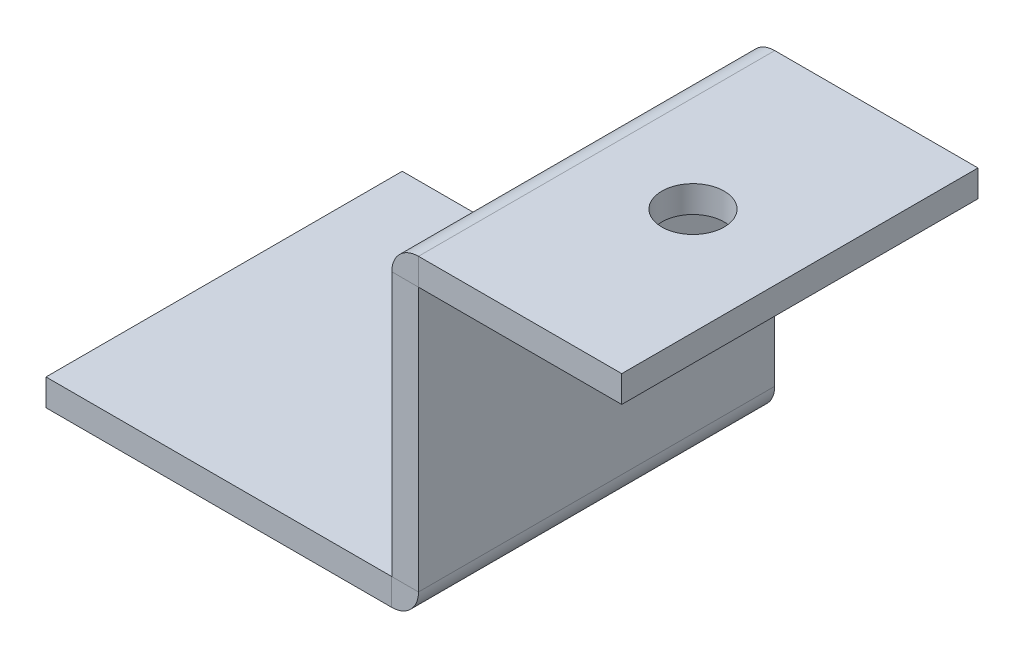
ISO-10303-21;
HEADER;
FILE_DESCRIPTION(('STEP AP214'),'2;1');
FILE_NAME('part.step','',(''),(''),'','','');
FILE_SCHEMA(('AUTOMOTIVE_DESIGN { 1 0 10303 214 1 1 1 1 }'));
ENDSEC;
DATA;
#1=APPLICATION_CONTEXT('core data for automotive mechanical design processes');
#2=APPLICATION_PROTOCOL_DEFINITION('international standard','automotive_design',2000,#1);
#3=PRODUCT_CONTEXT('',#1,'mechanical');
#4=PRODUCT('Part','Part','',(#3));
#5=PRODUCT_RELATED_PRODUCT_CATEGORY('part','',(#4));
#6=PRODUCT_DEFINITION_FORMATION('','',#4);
#7=PRODUCT_DEFINITION_CONTEXT('part definition',#1,'design');
#8=PRODUCT_DEFINITION('design','',#6,#7);
#9=PRODUCT_DEFINITION_SHAPE('','',#8);
#10=(LENGTH_UNIT() NAMED_UNIT(*) SI_UNIT(.MILLI.,.METRE.));
#11=(NAMED_UNIT(*) PLANE_ANGLE_UNIT() SI_UNIT($,.RADIAN.));
#12=(NAMED_UNIT(*) SI_UNIT($,.STERADIAN.) SOLID_ANGLE_UNIT());
#13=UNCERTAINTY_MEASURE_WITH_UNIT(LENGTH_MEASURE(1.E-05),#10,'distance_accuracy_value','');
#14=(GEOMETRIC_REPRESENTATION_CONTEXT(3) GLOBAL_UNCERTAINTY_ASSIGNED_CONTEXT((#13)) GLOBAL_UNIT_ASSIGNED_CONTEXT((#10,
#11,#12)) REPRESENTATION_CONTEXT('',''));
#15=CARTESIAN_POINT('',(0.,0.,0.));
#16=DIRECTION('',(0.,0.,1.));
#17=DIRECTION('',(1.,0.,0.));
#18=AXIS2_PLACEMENT_3D('',#15,#16,#17);
#19=CARTESIAN_POINT('',(-11.4111659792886,11.0888340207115,0.));
#20=DIRECTION('',(-1.,0.,0.));
#21=DIRECTION('',(0.,0.,1.));
#22=AXIS2_PLACEMENT_3D('',#19,#20,#21);
#23=PLANE('',#22);
#24=DIRECTION('',(0.,1.,0.));
#25=VECTOR('',#24,1.);
#26=CARTESIAN_POINT('',(-11.4111659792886,11.0888340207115,0.));
#27=LINE('',#26,#25);
#28=CARTESIAN_POINT('',(-11.4111659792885,-16.321331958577,0.));
#29=VERTEX_POINT('',#28);
#30=CARTESIAN_POINT('',(-11.4111659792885,-1.501,0.));
#31=VERTEX_POINT('',#30);
#32=EDGE_CURVE('E48',#29,#31,#27,.T.);
#33=ORIENTED_EDGE('',*,*,#32,.F.);
#34=DIRECTION('',(0.,0.,-1.));
#35=VECTOR('',#34,1.);
#36=CARTESIAN_POINT('',(-11.4111659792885,-16.321331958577,0.));
#37=LINE('',#36,#35);
#38=CARTESIAN_POINT('',(-11.4111659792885,-16.321331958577,-20.));
#39=VERTEX_POINT('',#38);
#40=EDGE_CURVE('E235',#29,#39,#37,.T.);
#41=ORIENTED_EDGE('',*,*,#40,.T.);
#42=DIRECTION('',(0.,-1.,0.));
#43=VECTOR('',#42,1.);
#44=CARTESIAN_POINT('',(-11.4111659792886,11.0888340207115,-20.));
#45=LINE('',#44,#43);
#46=CARTESIAN_POINT('',(-11.4111659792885,-1.501,-20.));
#47=VERTEX_POINT('',#46);
#48=EDGE_CURVE('E243',#47,#39,#45,.T.);
#49=ORIENTED_EDGE('',*,*,#48,.F.);
#50=DIRECTION('',(0.,0.,-1.));
#51=VECTOR('',#50,1.);
#52=CARTESIAN_POINT('',(-11.4111659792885,-1.501,0.));
#53=LINE('',#52,#51);
#54=EDGE_CURVE('E226',#31,#47,#53,.T.);
#55=ORIENTED_EDGE('',*,*,#54,.F.);
#56=EDGE_LOOP('',(#33,#41,#49,#55));
#57=FACE_BOUND('',#56,.T.);
#58=ADVANCED_FACE('F44',(#57),#23,.F.);
#59=CARTESIAN_POINT('',(-11.4111659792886,11.0888340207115,0.));
#60=DIRECTION('',(0.,0.,1.));
#61=DIRECTION('',(0.,1.,0.));
#62=AXIS2_PLACEMENT_3D('',#59,#60,#61);
#63=PLANE('',#62);
#64=DIRECTION('',(-1.,0.,0.));
#65=VECTOR('',#64,1.);
#66=CARTESIAN_POINT('',(-11.4111659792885,-16.321331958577,0.));
#67=LINE('',#66,#65);
#68=CARTESIAN_POINT('',(-12.9111659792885,-16.321331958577,0.));
#69=VERTEX_POINT('',#68);
#70=EDGE_CURVE('E238',#29,#69,#67,.T.);
#71=ORIENTED_EDGE('',*,*,#70,.F.);
#72=ORIENTED_EDGE('',*,*,#32,.T.);
#73=DIRECTION('',(-1.,0.,0.));
#74=VECTOR('',#73,1.);
#75=CARTESIAN_POINT('',(-11.4111659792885,-1.501,0.));
#76=LINE('',#75,#74);
#77=CARTESIAN_POINT('',(-12.9111659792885,-1.50100000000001,0.));
#78=VERTEX_POINT('',#77);
#79=EDGE_CURVE('E233',#31,#78,#76,.T.);
#80=ORIENTED_EDGE('',*,*,#79,.T.);
#81=DIRECTION('',(0.,1.,0.));
#82=VECTOR('',#81,1.);
#83=CARTESIAN_POINT('',(-12.9111659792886,11.0888340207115,0.));
#84=LINE('',#83,#82);
#85=EDGE_CURVE('E69',#69,#78,#84,.T.);
#86=ORIENTED_EDGE('',*,*,#85,.F.);
#87=EDGE_LOOP('',(#71,#72,#80,#86));
#88=FACE_BOUND('',#87,.T.);
#89=ADVANCED_FACE('F249',(#88),#63,.T.);
#90=CARTESIAN_POINT('',(-11.4111659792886,11.0888340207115,-20.));
#91=DIRECTION('',(0.,0.,-1.));
#92=DIRECTION('',(0.,-1.,0.));
#93=AXIS2_PLACEMENT_3D('',#90,#91,#92);
#94=PLANE('',#93);
#95=DIRECTION('',(1.,0.,0.));
#96=VECTOR('',#95,1.);
#97=CARTESIAN_POINT('',(-11.4111659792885,-16.321331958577,-20.));
#98=LINE('',#97,#96);
#99=CARTESIAN_POINT('',(-12.9111659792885,-16.321331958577,-20.));
#100=VERTEX_POINT('',#99);
#101=EDGE_CURVE('E12',#100,#39,#98,.T.);
#102=ORIENTED_EDGE('',*,*,#101,.F.);
#103=DIRECTION('',(0.,-1.,0.));
#104=VECTOR('',#103,1.);
#105=CARTESIAN_POINT('',(-12.9111659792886,11.0888340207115,-20.));
#106=LINE('',#105,#104);
#107=CARTESIAN_POINT('',(-12.9111659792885,-1.50100000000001,-20.));
#108=VERTEX_POINT('',#107);
#109=EDGE_CURVE('E61',#108,#100,#106,.T.);
#110=ORIENTED_EDGE('',*,*,#109,.F.);
#111=DIRECTION('',(1.,0.,0.));
#112=VECTOR('',#111,1.);
#113=CARTESIAN_POINT('',(-11.4111659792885,-1.501,-20.));
#114=LINE('',#113,#112);
#115=EDGE_CURVE('E229',#108,#47,#114,.T.);
#116=ORIENTED_EDGE('',*,*,#115,.T.);
#117=ORIENTED_EDGE('',*,*,#48,.T.);
#118=EDGE_LOOP('',(#102,#110,#116,#117));
#119=FACE_BOUND('',#118,.T.);
#120=ADVANCED_FACE('F46',(#119),#94,.T.);
#121=CARTESIAN_POINT('',(-12.9111659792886,11.0888340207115,0.));
#122=DIRECTION('',(-1.,0.,0.));
#123=DIRECTION('',(0.,0.,1.));
#124=AXIS2_PLACEMENT_3D('',#121,#122,#123);
#125=PLANE('',#124);
#126=DIRECTION('',(0.,0.,-1.));
#127=VECTOR('',#126,1.);
#128=CARTESIAN_POINT('',(-12.9111659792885,-16.321331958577,0.));
#129=LINE('',#128,#127);
#130=EDGE_CURVE('E53',#69,#100,#129,.T.);
#131=ORIENTED_EDGE('',*,*,#130,.F.);
#132=ORIENTED_EDGE('',*,*,#85,.T.);
#133=DIRECTION('',(0.,0.,-1.));
#134=VECTOR('',#133,1.);
#135=CARTESIAN_POINT('',(-12.9111659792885,-1.50100000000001,0.));
#136=LINE('',#135,#134);
#137=EDGE_CURVE('E231',#78,#108,#136,.T.);
#138=ORIENTED_EDGE('',*,*,#137,.T.);
#139=ORIENTED_EDGE('',*,*,#109,.T.);
#140=EDGE_LOOP('',(#131,#132,#138,#139));
#141=FACE_BOUND('',#140,.T.);
#142=ADVANCED_FACE('F245',(#141),#125,.T.);
#143=CARTESIAN_POINT('',(0.,-1.5,0.));
#144=DIRECTION('',(1.,0.,0.));
#145=DIRECTION('',(0.,0.,-1.));
#146=AXIS2_PLACEMENT_3D('',#143,#144,#145);
#147=PLANE('',#146);
#148=DIRECTION('',(0.,0.,-1.));
#149=VECTOR('',#148,1.);
#150=CARTESIAN_POINT('',(0.,0.,0.));
#151=LINE('',#150,#149);
#152=CARTESIAN_POINT('',(0.,0.,0.));
#153=VERTEX_POINT('',#152);
#154=CARTESIAN_POINT('',(0.,0.,-20.));
#155=VERTEX_POINT('',#154);
#156=EDGE_CURVE('E197',#153,#155,#151,.T.);
#157=ORIENTED_EDGE('',*,*,#156,.F.);
#158=DIRECTION('',(0.,1.,0.));
#159=VECTOR('',#158,1.);
#160=CARTESIAN_POINT('',(0.,-1.5,0.));
#161=LINE('',#160,#159);
#162=CARTESIAN_POINT('',(0.,-1.5,0.));
#163=VERTEX_POINT('',#162);
#164=EDGE_CURVE('E190',#163,#153,#161,.T.);
#165=ORIENTED_EDGE('',*,*,#164,.F.);
#166=DIRECTION('',(0.,0.,-1.));
#167=VECTOR('',#166,1.);
#168=CARTESIAN_POINT('',(0.,-1.5,0.));
#169=LINE('',#168,#167);
#170=CARTESIAN_POINT('',(0.,-1.5,-20.));
#171=VERTEX_POINT('',#170);
#172=EDGE_CURVE('E215',#163,#171,#169,.T.);
#173=ORIENTED_EDGE('',*,*,#172,.T.);
#174=DIRECTION('',(0.,1.,0.));
#175=VECTOR('',#174,1.);
#176=CARTESIAN_POINT('',(0.,-1.5,-20.));
#177=LINE('',#176,#175);
#178=EDGE_CURVE('E213',#171,#155,#177,.T.);
#179=ORIENTED_EDGE('',*,*,#178,.T.);
#180=EDGE_LOOP('',(#157,#165,#173,#179));
#181=FACE_BOUND('',#180,.T.);
#182=ADVANCED_FACE('F286',(#181),#147,.T.);
#183=CARTESIAN_POINT('',(-6.,-1.5,-10.));
#184=DIRECTION('',(0.,1.,0.));
#185=DIRECTION('',(0.,0.,1.));
#186=AXIS2_PLACEMENT_3D('',#183,#184,#185);
#187=CYLINDRICAL_SURFACE('',#186,1.75);
#188=CARTESIAN_POINT('',(-6.,-1.5,-10.));
#189=DIRECTION('',(0.,1.,0.));
#190=DIRECTION('',(0.,0.,1.));
#191=AXIS2_PLACEMENT_3D('',#188,#189,#190);
#192=CIRCLE('',#191,1.75);
#193=CARTESIAN_POINT('',(-6.,-1.5,-8.25));
#194=VERTEX_POINT('',#193);
#195=EDGE_CURVE('E207',#194,#194,#192,.T.);
#196=ORIENTED_EDGE('',*,*,#195,.F.);
#197=EDGE_LOOP('',(#196));
#198=FACE_BOUND('',#197,.T.);
#199=CARTESIAN_POINT('',(-6.,0.,-10.));
#200=DIRECTION('',(0.,1.,0.));
#201=DIRECTION('',(0.,0.,1.));
#202=AXIS2_PLACEMENT_3D('',#199,#200,#201);
#203=CIRCLE('',#202,1.75);
#204=CARTESIAN_POINT('',(-6.,0.,-8.25));
#205=VERTEX_POINT('',#204);
#206=EDGE_CURVE('E210',#205,#205,#203,.T.);
#207=ORIENTED_EDGE('',*,*,#206,.T.);
#208=EDGE_LOOP('',(#207));
#209=FACE_BOUND('',#208,.T.);
#210=ADVANCED_FACE('F288',(#198,#209),#187,.F.);
#211=CARTESIAN_POINT('',(0.,-1.5,0.));
#212=DIRECTION('',(0.,1.,0.));
#213=DIRECTION('',(0.,0.,1.));
#214=AXIS2_PLACEMENT_3D('',#211,#212,#213);
#215=PLANE('',#214);
#216=ORIENTED_EDGE('',*,*,#195,.T.);
#217=EDGE_LOOP('',(#216));
#218=FACE_BOUND('',#217,.T.);
#219=DIRECTION('',(1.,0.,0.));
#220=VECTOR('',#219,1.);
#221=CARTESIAN_POINT('',(0.,-1.5,0.));
#222=LINE('',#221,#220);
#223=CARTESIAN_POINT('',(-11.4101659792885,-1.5,0.));
#224=VERTEX_POINT('',#223);
#225=EDGE_CURVE('E193',#224,#163,#222,.T.);
#226=ORIENTED_EDGE('',*,*,#225,.F.);
#227=DIRECTION('',(0.,0.,-1.));
#228=VECTOR('',#227,1.);
#229=CARTESIAN_POINT('',(-11.4101659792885,-1.5,0.));
#230=LINE('',#229,#228);
#231=CARTESIAN_POINT('',(-11.4101659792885,-1.5,-20.));
#232=VERTEX_POINT('',#231);
#233=EDGE_CURVE('E204',#224,#232,#230,.T.);
#234=ORIENTED_EDGE('',*,*,#233,.T.);
#235=DIRECTION('',(-1.,0.,0.));
#236=VECTOR('',#235,1.);
#237=CARTESIAN_POINT('',(0.,-1.5,-20.));
#238=LINE('',#237,#236);
#239=EDGE_CURVE('E202',#171,#232,#238,.T.);
#240=ORIENTED_EDGE('',*,*,#239,.F.);
#241=ORIENTED_EDGE('',*,*,#172,.F.);
#242=EDGE_LOOP('',(#226,#234,#240,#241));
#243=FACE_BOUND('',#242,.T.);
#244=ADVANCED_FACE('F283',(#218,#243),#215,.F.);
#245=CARTESIAN_POINT('',(0.,-1.5,-20.));
#246=DIRECTION('',(0.,0.,-1.));
#247=DIRECTION('',(-1.,0.,0.));
#248=AXIS2_PLACEMENT_3D('',#245,#246,#247);
#249=PLANE('',#248);
#250=DIRECTION('',(0.,-1.,0.));
#251=VECTOR('',#250,1.);
#252=CARTESIAN_POINT('',(-11.4101659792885,-1.5,-20.));
#253=LINE('',#252,#251);
#254=CARTESIAN_POINT('',(-11.4101659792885,0.,-20.));
#255=VERTEX_POINT('',#254);
#256=EDGE_CURVE('E218',#255,#232,#253,.T.);
#257=ORIENTED_EDGE('',*,*,#256,.F.);
#258=DIRECTION('',(-1.,0.,0.));
#259=VECTOR('',#258,1.);
#260=CARTESIAN_POINT('',(0.,0.,-20.));
#261=LINE('',#260,#259);
#262=EDGE_CURVE('E195',#155,#255,#261,.T.);
#263=ORIENTED_EDGE('',*,*,#262,.F.);
#264=ORIENTED_EDGE('',*,*,#178,.F.);
#265=ORIENTED_EDGE('',*,*,#239,.T.);
#266=EDGE_LOOP('',(#257,#263,#264,#265));
#267=FACE_BOUND('',#266,.T.);
#268=ADVANCED_FACE('F271',(#267),#249,.T.);
#269=CARTESIAN_POINT('',(0.,0.,0.));
#270=DIRECTION('',(0.,1.,0.));
#271=DIRECTION('',(0.,0.,1.));
#272=AXIS2_PLACEMENT_3D('',#269,#270,#271);
#273=PLANE('',#272);
#274=DIRECTION('',(0.,0.,-1.));
#275=VECTOR('',#274,1.);
#276=CARTESIAN_POINT('',(-11.4101659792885,0.,0.));
#277=LINE('',#276,#275);
#278=CARTESIAN_POINT('',(-11.4101659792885,0.,0.));
#279=VERTEX_POINT('',#278);
#280=EDGE_CURVE('E221',#279,#255,#277,.T.);
#281=ORIENTED_EDGE('',*,*,#280,.F.);
#282=DIRECTION('',(1.,0.,0.));
#283=VECTOR('',#282,1.);
#284=CARTESIAN_POINT('',(0.,0.,0.));
#285=LINE('',#284,#283);
#286=EDGE_CURVE('E200',#279,#153,#285,.T.);
#287=ORIENTED_EDGE('',*,*,#286,.T.);
#288=ORIENTED_EDGE('',*,*,#156,.T.);
#289=ORIENTED_EDGE('',*,*,#262,.T.);
#290=EDGE_LOOP('',(#281,#287,#288,#289));
#291=FACE_BOUND('',#290,.T.);
#292=ORIENTED_EDGE('',*,*,#206,.F.);
#293=EDGE_LOOP('',(#292));
#294=FACE_BOUND('',#293,.T.);
#295=ADVANCED_FACE('F266',(#291,#294),#273,.T.);
#296=CARTESIAN_POINT('',(0.,-1.5,0.));
#297=DIRECTION('',(0.,0.,1.));
#298=DIRECTION('',(1.,0.,0.));
#299=AXIS2_PLACEMENT_3D('',#296,#297,#298);
#300=PLANE('',#299);
#301=DIRECTION('',(0.,1.,0.));
#302=VECTOR('',#301,1.);
#303=CARTESIAN_POINT('',(-11.4101659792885,-1.5,0.));
#304=LINE('',#303,#302);
#305=EDGE_CURVE('E185',#224,#279,#304,.T.);
#306=ORIENTED_EDGE('',*,*,#305,.F.);
#307=ORIENTED_EDGE('',*,*,#225,.T.);
#308=ORIENTED_EDGE('',*,*,#164,.T.);
#309=ORIENTED_EDGE('',*,*,#286,.F.);
#310=EDGE_LOOP('',(#306,#307,#308,#309));
#311=FACE_BOUND('',#310,.T.);
#312=ADVANCED_FACE('F261',(#311),#300,.T.);
#313=CARTESIAN_POINT('',(-11.4101659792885,-1.501,0.));
#314=DIRECTION('',(0.,0.,-1.));
#315=DIRECTION('',(-1.,0.,0.));
#316=AXIS2_PLACEMENT_3D('',#313,#314,#315);
#317=PLANE('',#316);
#318=ORIENTED_EDGE('',*,*,#305,.T.);
#319=CARTESIAN_POINT('',(-11.4101659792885,-1.501,0.));
#320=DIRECTION('',(0.,0.,-1.));
#321=DIRECTION('',(-1.,0.,0.));
#322=AXIS2_PLACEMENT_3D('',#319,#320,#321);
#323=CIRCLE('',#322,1.501);
#324=EDGE_CURVE('E173',#279,#78,#323,.F.);
#325=ORIENTED_EDGE('',*,*,#324,.T.);
#326=ORIENTED_EDGE('',*,*,#79,.F.);
#327=CARTESIAN_POINT('',(-11.4101659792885,-1.501,0.));
#328=DIRECTION('',(0.,0.,1.));
#329=DIRECTION('',(-1.,0.,0.));
#330=AXIS2_PLACEMENT_3D('',#327,#328,#329);
#331=CIRCLE('',#330,0.000999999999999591);
#332=EDGE_CURVE('E178',#224,#31,#331,.T.);
#333=ORIENTED_EDGE('',*,*,#332,.F.);
#334=EDGE_LOOP('',(#318,#325,#326,#333));
#335=FACE_BOUND('',#334,.T.);
#336=ADVANCED_FACE('F257',(#335),#317,.F.);
#337=CARTESIAN_POINT('',(-11.4101659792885,-1.501,-20.));
#338=DIRECTION('',(0.,0.,1.));
#339=DIRECTION('',(1.,0.,0.));
#340=AXIS2_PLACEMENT_3D('',#337,#338,#339);
#341=PLANE('',#340);
#342=ORIENTED_EDGE('',*,*,#115,.F.);
#343=CARTESIAN_POINT('',(-11.4101659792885,-1.501,-20.));
#344=DIRECTION('',(0.,0.,-1.));
#345=DIRECTION('',(-1.,0.,0.));
#346=AXIS2_PLACEMENT_3D('',#343,#344,#345);
#347=CIRCLE('',#346,1.501);
#348=EDGE_CURVE('E182',#108,#255,#347,.T.);
#349=ORIENTED_EDGE('',*,*,#348,.T.);
#350=ORIENTED_EDGE('',*,*,#256,.T.);
#351=CARTESIAN_POINT('',(-11.4101659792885,-1.501,-20.));
#352=DIRECTION('',(0.,0.,-1.));
#353=DIRECTION('',(1.,0.,0.));
#354=AXIS2_PLACEMENT_3D('',#351,#352,#353);
#355=CIRCLE('',#354,0.000999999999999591);
#356=EDGE_CURVE('E181',#47,#232,#355,.T.);
#357=ORIENTED_EDGE('',*,*,#356,.F.);
#358=EDGE_LOOP('',(#342,#349,#350,#357));
#359=FACE_BOUND('',#358,.T.);
#360=ADVANCED_FACE('F275',(#359),#341,.F.);
#361=CARTESIAN_POINT('',(-11.4101659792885,-1.501,10.0908341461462));
#362=DIRECTION('',(0.,0.,-1.));
#363=DIRECTION('',(-1.,0.,0.));
#364=AXIS2_PLACEMENT_3D('',#361,#362,#363);
#365=CYLINDRICAL_SURFACE('',#364,0.001);
#366=ORIENTED_EDGE('',*,*,#356,.T.);
#367=ORIENTED_EDGE('',*,*,#233,.F.);
#368=ORIENTED_EDGE('',*,*,#332,.T.);
#369=ORIENTED_EDGE('',*,*,#54,.T.);
#370=EDGE_LOOP('',(#366,#367,#368,#369));
#371=FACE_BOUND('',#370,.T.);
#372=ADVANCED_FACE('F281',(#371),#365,.F.);
#373=CARTESIAN_POINT('',(-11.4101659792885,-1.501,10.0908341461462));
#374=DIRECTION('',(0.,0.,-1.));
#375=DIRECTION('',(-1.,0.,0.));
#376=AXIS2_PLACEMENT_3D('',#373,#374,#375);
#377=CYLINDRICAL_SURFACE('',#376,1.501);
#378=ORIENTED_EDGE('',*,*,#348,.F.);
#379=ORIENTED_EDGE('',*,*,#137,.F.);
#380=ORIENTED_EDGE('',*,*,#324,.F.);
#381=ORIENTED_EDGE('',*,*,#280,.T.);
#382=EDGE_LOOP('',(#378,#379,#380,#381));
#383=FACE_BOUND('',#382,.T.);
#384=ADVANCED_FACE('F256',(#383),#377,.T.);
#385=CARTESIAN_POINT('',(-12.9121659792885,-16.321331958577,0.));
#386=DIRECTION('',(0.,0.,1.));
#387=DIRECTION('',(1.,0.,0.));
#388=AXIS2_PLACEMENT_3D('',#385,#386,#387);
#389=PLANE('',#388);
#390=ORIENTED_EDGE('',*,*,#70,.T.);
#391=CARTESIAN_POINT('',(-12.9121659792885,-16.321331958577,0.));
#392=DIRECTION('',(0.,0.,-1.));
#393=DIRECTION('',(-1.,0.,0.));
#394=AXIS2_PLACEMENT_3D('',#391,#392,#393);
#395=CIRCLE('',#394,0.000999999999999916);
#396=CARTESIAN_POINT('',(-12.9121659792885,-16.322331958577,0.));
#397=VERTEX_POINT('',#396);
#398=EDGE_CURVE('E154',#69,#397,#395,.T.);
#399=ORIENTED_EDGE('',*,*,#398,.T.);
#400=DIRECTION('',(0.,1.,0.));
#401=VECTOR('',#400,1.);
#402=CARTESIAN_POINT('',(-12.9121659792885,-17.822331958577,0.));
#403=LINE('',#402,#401);
#404=CARTESIAN_POINT('',(-12.9121659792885,-17.822331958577,0.));
#405=VERTEX_POINT('',#404);
#406=EDGE_CURVE('E539',#405,#397,#403,.T.);
#407=ORIENTED_EDGE('',*,*,#406,.F.);
#408=CARTESIAN_POINT('',(-12.9121659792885,-16.321331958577,0.));
#409=DIRECTION('',(0.,0.,-1.));
#410=DIRECTION('',(1.,0.,0.));
#411=AXIS2_PLACEMENT_3D('',#408,#409,#410);
#412=CIRCLE('',#411,1.501);
#413=EDGE_CURVE('E166',#29,#405,#412,.T.);
#414=ORIENTED_EDGE('',*,*,#413,.F.);
#415=EDGE_LOOP('',(#390,#399,#407,#414));
#416=FACE_BOUND('',#415,.T.);
#417=ADVANCED_FACE('F354',(#416),#389,.T.);
#418=CARTESIAN_POINT('',(-12.9121659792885,-16.321331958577,-20.));
#419=DIRECTION('',(0.,0.,-1.));
#420=DIRECTION('',(-1.,0.,0.));
#421=AXIS2_PLACEMENT_3D('',#418,#419,#420);
#422=PLANE('',#421);
#423=DIRECTION('',(0.,-1.,0.));
#424=VECTOR('',#423,1.);
#425=CARTESIAN_POINT('',(-12.9121659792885,-17.822331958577,-20.));
#426=LINE('',#425,#424);
#427=CARTESIAN_POINT('',(-12.9121659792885,-16.322331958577,-20.));
#428=VERTEX_POINT('',#427);
#429=CARTESIAN_POINT('',(-12.9121659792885,-17.822331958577,-20.));
#430=VERTEX_POINT('',#429);
#431=EDGE_CURVE('E142',#428,#430,#426,.T.);
#432=ORIENTED_EDGE('',*,*,#431,.F.);
#433=CARTESIAN_POINT('',(-12.9121659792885,-16.321331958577,-20.));
#434=DIRECTION('',(0.,0.,-1.));
#435=DIRECTION('',(-1.,0.,0.));
#436=AXIS2_PLACEMENT_3D('',#433,#434,#435);
#437=CIRCLE('',#436,0.000999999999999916);
#438=EDGE_CURVE('E170',#428,#100,#437,.F.);
#439=ORIENTED_EDGE('',*,*,#438,.T.);
#440=ORIENTED_EDGE('',*,*,#101,.T.);
#441=CARTESIAN_POINT('',(-12.9121659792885,-16.321331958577,-20.));
#442=DIRECTION('',(0.,0.,1.));
#443=DIRECTION('',(-1.,0.,0.));
#444=AXIS2_PLACEMENT_3D('',#441,#442,#443);
#445=CIRCLE('',#444,1.501);
#446=EDGE_CURVE('E169',#430,#39,#445,.T.);
#447=ORIENTED_EDGE('',*,*,#446,.F.);
#448=EDGE_LOOP('',(#432,#439,#440,#447));
#449=FACE_BOUND('',#448,.T.);
#450=ADVANCED_FACE('F361',(#449),#422,.T.);
#451=CARTESIAN_POINT('',(-12.9121659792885,-16.321331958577,10.0908341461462));
#452=DIRECTION('',(0.,0.,-1.));
#453=DIRECTION('',(-1.,0.,0.));
#454=AXIS2_PLACEMENT_3D('',#451,#452,#453);
#455=CYLINDRICAL_SURFACE('',#454,1.501);
#456=ORIENTED_EDGE('',*,*,#446,.T.);
#457=ORIENTED_EDGE('',*,*,#40,.F.);
#458=ORIENTED_EDGE('',*,*,#413,.T.);
#459=DIRECTION('',(0.,0.,-1.));
#460=VECTOR('',#459,1.);
#461=CARTESIAN_POINT('',(-12.9121659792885,-17.822331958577,0.));
#462=LINE('',#461,#460);
#463=EDGE_CURVE('E160',#405,#430,#462,.T.);
#464=ORIENTED_EDGE('',*,*,#463,.T.);
#465=EDGE_LOOP('',(#456,#457,#458,#464));
#466=FACE_BOUND('',#465,.T.);
#467=ADVANCED_FACE('F370',(#466),#455,.T.);
#468=CARTESIAN_POINT('',(-12.9121659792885,-16.321331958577,10.0908341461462));
#469=DIRECTION('',(0.,0.,-1.));
#470=DIRECTION('',(-1.,0.,0.));
#471=AXIS2_PLACEMENT_3D('',#468,#469,#470);
#472=CYLINDRICAL_SURFACE('',#471,0.000999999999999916);
#473=ORIENTED_EDGE('',*,*,#438,.F.);
#474=DIRECTION('',(0.,0.,-1.));
#475=VECTOR('',#474,1.);
#476=CARTESIAN_POINT('',(-12.9121659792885,-16.322331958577,0.));
#477=LINE('',#476,#475);
#478=EDGE_CURVE('E538',#397,#428,#477,.T.);
#479=ORIENTED_EDGE('',*,*,#478,.F.);
#480=ORIENTED_EDGE('',*,*,#398,.F.);
#481=ORIENTED_EDGE('',*,*,#130,.T.);
#482=EDGE_LOOP('',(#473,#479,#480,#481));
#483=FACE_BOUND('',#482,.T.);
#484=ADVANCED_FACE('F378',(#483),#472,.F.);
#485=CARTESIAN_POINT('',(-32.322331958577,-17.822331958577,0.));
#486=DIRECTION('',(-1.,0.,0.));
#487=DIRECTION('',(0.,0.,1.));
#488=AXIS2_PLACEMENT_3D('',#485,#486,#487);
#489=PLANE('',#488);
#490=DIRECTION('',(0.,0.,1.));
#491=VECTOR('',#490,1.);
#492=CARTESIAN_POINT('',(-32.322331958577,-16.322331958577,0.));
#493=LINE('',#492,#491);
#494=CARTESIAN_POINT('',(-32.322331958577,-16.322331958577,-20.));
#495=VERTEX_POINT('',#494);
#496=CARTESIAN_POINT('',(-32.322331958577,-16.322331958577,0.));
#497=VERTEX_POINT('',#496);
#498=EDGE_CURVE('E153',#495,#497,#493,.T.);
#499=ORIENTED_EDGE('',*,*,#498,.F.);
#500=DIRECTION('',(0.,1.,0.));
#501=VECTOR('',#500,1.);
#502=CARTESIAN_POINT('',(-32.322331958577,-17.822331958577,-20.));
#503=LINE('',#502,#501);
#504=CARTESIAN_POINT('',(-32.322331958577,-17.822331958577,-20.));
#505=VERTEX_POINT('',#504);
#506=EDGE_CURVE('E139',#505,#495,#503,.T.);
#507=ORIENTED_EDGE('',*,*,#506,.F.);
#508=DIRECTION('',(0.,0.,1.));
#509=VECTOR('',#508,1.);
#510=CARTESIAN_POINT('',(-32.322331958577,-17.822331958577,0.));
#511=LINE('',#510,#509);
#512=CARTESIAN_POINT('',(-32.322331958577,-17.822331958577,0.));
#513=VERTEX_POINT('',#512);
#514=EDGE_CURVE('E150',#505,#513,#511,.T.);
#515=ORIENTED_EDGE('',*,*,#514,.T.);
#516=DIRECTION('',(0.,1.,0.));
#517=VECTOR('',#516,1.);
#518=CARTESIAN_POINT('',(-32.322331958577,-17.822331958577,0.));
#519=LINE('',#518,#517);
#520=EDGE_CURVE('E159',#513,#497,#519,.T.);
#521=ORIENTED_EDGE('',*,*,#520,.T.);
#522=EDGE_LOOP('',(#499,#507,#515,#521));
#523=FACE_BOUND('',#522,.T.);
#524=ADVANCED_FACE('F149',(#523),#489,.T.);
#525=CARTESIAN_POINT('',(15.677668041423,-17.822331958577,0.));
#526=DIRECTION('',(0.,1.,0.));
#527=DIRECTION('',(0.,0.,1.));
#528=AXIS2_PLACEMENT_3D('',#525,#526,#527);
#529=PLANE('',#528);
#530=ORIENTED_EDGE('',*,*,#463,.F.);
#531=DIRECTION('',(1.,0.,0.));
#532=VECTOR('',#531,1.);
#533=CARTESIAN_POINT('',(15.677668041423,-17.822331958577,0.));
#534=LINE('',#533,#532);
#535=EDGE_CURVE('E158',#513,#405,#534,.T.);
#536=ORIENTED_EDGE('',*,*,#535,.F.);
#537=ORIENTED_EDGE('',*,*,#514,.F.);
#538=DIRECTION('',(-1.,0.,0.));
#539=VECTOR('',#538,1.);
#540=CARTESIAN_POINT('',(15.677668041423,-17.822331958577,-20.));
#541=LINE('',#540,#539);
#542=EDGE_CURVE('E136',#430,#505,#541,.T.);
#543=ORIENTED_EDGE('',*,*,#542,.F.);
#544=EDGE_LOOP('',(#530,#536,#537,#543));
#545=FACE_BOUND('',#544,.T.);
#546=ADVANCED_FACE('F156',(#545),#529,.F.);
#547=CARTESIAN_POINT('',(15.677668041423,-17.822331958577,0.));
#548=DIRECTION('',(0.,0.,1.));
#549=DIRECTION('',(1.,0.,0.));
#550=AXIS2_PLACEMENT_3D('',#547,#548,#549);
#551=PLANE('',#550);
#552=ORIENTED_EDGE('',*,*,#535,.T.);
#553=ORIENTED_EDGE('',*,*,#406,.T.);
#554=DIRECTION('',(1.,0.,0.));
#555=VECTOR('',#554,1.);
#556=CARTESIAN_POINT('',(15.677668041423,-16.322331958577,0.));
#557=LINE('',#556,#555);
#558=EDGE_CURVE('E535',#497,#397,#557,.T.);
#559=ORIENTED_EDGE('',*,*,#558,.F.);
#560=ORIENTED_EDGE('',*,*,#520,.F.);
#561=EDGE_LOOP('',(#552,#553,#559,#560));
#562=FACE_BOUND('',#561,.T.);
#563=ADVANCED_FACE('F399',(#562),#551,.T.);
#564=CARTESIAN_POINT('',(15.677668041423,-16.322331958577,0.));
#565=DIRECTION('',(0.,1.,0.));
#566=DIRECTION('',(0.,0.,1.));
#567=AXIS2_PLACEMENT_3D('',#564,#565,#566);
#568=PLANE('',#567);
#569=ORIENTED_EDGE('',*,*,#558,.T.);
#570=ORIENTED_EDGE('',*,*,#478,.T.);
#571=DIRECTION('',(-1.,0.,0.));
#572=VECTOR('',#571,1.);
#573=CARTESIAN_POINT('',(15.677668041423,-16.322331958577,-20.));
#574=LINE('',#573,#572);
#575=EDGE_CURVE('E546',#428,#495,#574,.T.);
#576=ORIENTED_EDGE('',*,*,#575,.T.);
#577=ORIENTED_EDGE('',*,*,#498,.T.);
#578=EDGE_LOOP('',(#569,#570,#576,#577));
#579=FACE_BOUND('',#578,.T.);
#580=ADVANCED_FACE('F406',(#579),#568,.T.);
#581=CARTESIAN_POINT('',(15.677668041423,-17.822331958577,-20.));
#582=DIRECTION('',(0.,0.,-1.));
#583=DIRECTION('',(-1.,0.,0.));
#584=AXIS2_PLACEMENT_3D('',#581,#582,#583);
#585=PLANE('',#584);
#586=ORIENTED_EDGE('',*,*,#575,.F.);
#587=ORIENTED_EDGE('',*,*,#431,.T.);
#588=ORIENTED_EDGE('',*,*,#542,.T.);
#589=ORIENTED_EDGE('',*,*,#506,.T.);
#590=EDGE_LOOP('',(#586,#587,#588,#589));
#591=FACE_BOUND('',#590,.T.);
#592=ADVANCED_FACE('F138',(#591),#585,.T.);
#593=CLOSED_SHELL('',(#58,#89,#120,#142,#182,#210,#244,#268,#295,#312,#336,#360,#372,#384,#417,
#450,#467,#484,#524,#546,#563,#580,#592));
#594=MANIFOLD_SOLID_BREP('B2',#593);
#595=ADVANCED_BREP_SHAPE_REPRESENTATION('',(#18,#594),#14);
#596=SHAPE_DEFINITION_REPRESENTATION(#9,#595);
ENDSEC;
END-ISO-10303-21;
